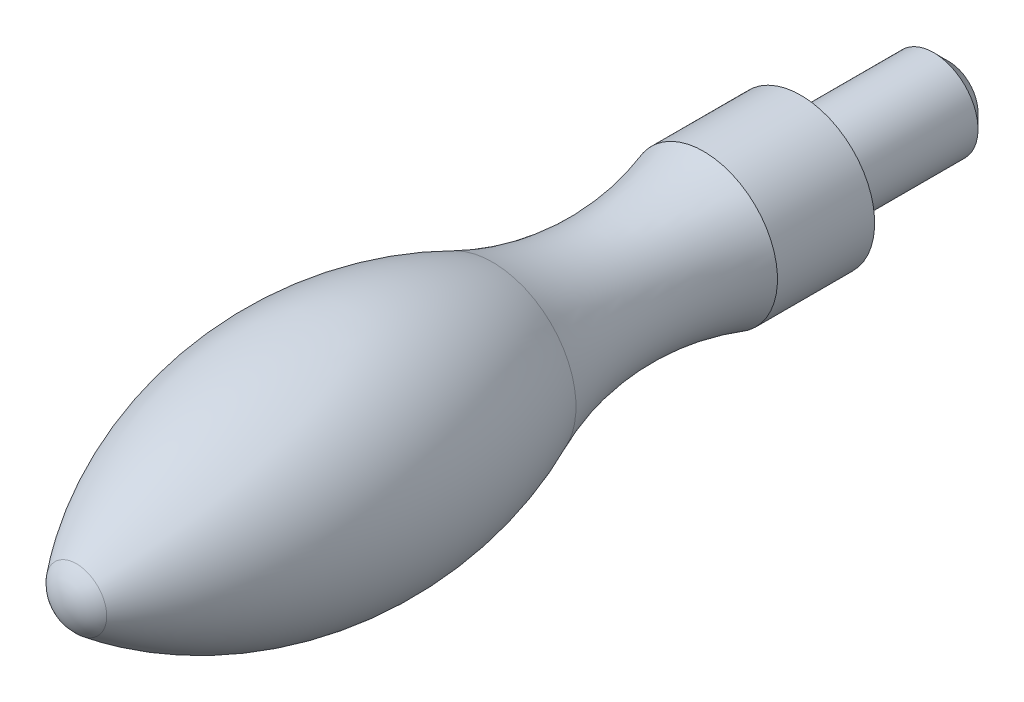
ISO-10303-21;
HEADER;
FILE_DESCRIPTION(('STEP AP214'),'2;1');
FILE_NAME('part.step','',(''),(''),'','','');
FILE_SCHEMA(('AUTOMOTIVE_DESIGN { 1 0 10303 214 1 1 1 1 }'));
ENDSEC;
DATA;
#1=APPLICATION_CONTEXT('core data for automotive mechanical design processes');
#2=APPLICATION_PROTOCOL_DEFINITION('international standard','automotive_design',2000,#1);
#3=PRODUCT_CONTEXT('',#1,'mechanical');
#4=PRODUCT('Part','Part','',(#3));
#5=PRODUCT_RELATED_PRODUCT_CATEGORY('part','',(#4));
#6=PRODUCT_DEFINITION_FORMATION('','',#4);
#7=PRODUCT_DEFINITION_CONTEXT('part definition',#1,'design');
#8=PRODUCT_DEFINITION('design','',#6,#7);
#9=PRODUCT_DEFINITION_SHAPE('','',#8);
#10=(LENGTH_UNIT() NAMED_UNIT(*) SI_UNIT(.MILLI.,.METRE.));
#11=(NAMED_UNIT(*) PLANE_ANGLE_UNIT() SI_UNIT($,.RADIAN.));
#12=(NAMED_UNIT(*) SI_UNIT($,.STERADIAN.) SOLID_ANGLE_UNIT());
#13=UNCERTAINTY_MEASURE_WITH_UNIT(LENGTH_MEASURE(1.E-05),#10,'distance_accuracy_value','');
#14=(GEOMETRIC_REPRESENTATION_CONTEXT(3) GLOBAL_UNCERTAINTY_ASSIGNED_CONTEXT((#13)) GLOBAL_UNIT_ASSIGNED_CONTEXT((#10,
#11,#12)) REPRESENTATION_CONTEXT('',''));
#15=CARTESIAN_POINT('',(0.,0.,0.));
#16=DIRECTION('',(0.,0.,1.));
#17=DIRECTION('',(1.,0.,0.));
#18=AXIS2_PLACEMENT_3D('',#15,#16,#17);
#19=CARTESIAN_POINT('',(0.,0.,94.5));
#20=DIRECTION('',(-1.,0.,0.));
#21=DIRECTION('',(0.,0.,1.));
#22=AXIS2_PLACEMENT_3D('',#19,#20,#21);
#23=SPHERICAL_SURFACE('',#22,5.5);
#24=CARTESIAN_POINT('',(0.,0.,94.5));
#25=DIRECTION('',(0.,0.,-1.));
#26=DIRECTION('',(-1.,0.,0.));
#27=AXIS2_PLACEMENT_3D('',#24,#25,#26);
#28=SPHERICAL_SURFACE('',#27,5.5);
#29=CARTESIAN_POINT('',(0.,0.,98.1578901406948));
#30=DIRECTION('',(0.,0.,-1.));
#31=DIRECTION('',(-1.,0.,0.));
#32=AXIS2_PLACEMENT_3D('',#29,#30,#31);
#33=CIRCLE('',#32,4.10729104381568);
#34=CARTESIAN_POINT('',(-4.10729104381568,0.,98.1578901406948));
#35=VERTEX_POINT('',#34);
#36=EDGE_CURVE('E23',#35,#35,#33,.T.);
#37=ORIENTED_EDGE('',*,*,#36,.F.);
#38=EDGE_LOOP('',(#37));
#39=FACE_BOUND('',#38,.T.);
#40=ADVANCED_FACE('F12',(#39),#28,.T.);
#41=CARTESIAN_POINT('',(0.,0.,64.));
#42=DIRECTION('',(0.,0.,-1.));
#43=DIRECTION('',(-1.,0.,0.));
#44=AXIS2_PLACEMENT_3D('',#41,#42,#43);
#45=DEGENERATE_TOROIDAL_SURFACE('',#44,39.,55.,.F.);
#46=CARTESIAN_POINT('',(0.,0.,41.7773793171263));
#47=DIRECTION('',(0.,0.,-1.));
#48=DIRECTION('',(-1.,0.,0.));
#49=AXIS2_PLACEMENT_3D('',#46,#47,#48);
#50=CIRCLE('',#49,11.310586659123);
#51=CARTESIAN_POINT('',(-11.310586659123,0.,41.7773793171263));
#52=VERTEX_POINT('',#51);
#53=EDGE_CURVE('E27',#52,#52,#50,.T.);
#54=ORIENTED_EDGE('',*,*,#53,.F.);
#55=EDGE_LOOP('',(#54));
#56=FACE_BOUND('',#55,.T.);
#57=ORIENTED_EDGE('',*,*,#36,.T.);
#58=EDGE_LOOP('',(#57));
#59=FACE_BOUND('',#58,.T.);
#60=ADVANCED_FACE('F61',(#56,#59),#45,.F.);
#61=CARTESIAN_POINT('',(0.,0.,25.74));
#62=DIRECTION('',(0.,0.,-1.));
#63=DIRECTION('',(-1.,0.,0.));
#64=AXIS2_PLACEMENT_3D('',#61,#62,#63);
#65=TOROIDAL_SURFACE('',#64,48.5,40.5);
#66=ORIENTED_EDGE('',*,*,#53,.T.);
#67=EDGE_LOOP('',(#66));
#68=FACE_BOUND('',#67,.T.);
#69=CARTESIAN_POINT('',(0.,0.,13.1701949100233));
#70=DIRECTION('',(0.,0.,-1.));
#71=DIRECTION('',(-1.,0.,0.));
#72=AXIS2_PLACEMENT_3D('',#69,#70,#71);
#73=CIRCLE('',#72,10.);
#74=CARTESIAN_POINT('',(-10.,0.,13.1701949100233));
#75=VERTEX_POINT('',#74);
#76=EDGE_CURVE('E32',#75,#75,#73,.T.);
#77=ORIENTED_EDGE('',*,*,#76,.F.);
#78=EDGE_LOOP('',(#77));
#79=FACE_BOUND('',#78,.T.);
#80=ADVANCED_FACE('F57',(#68,#79),#65,.F.);
#81=CARTESIAN_POINT('',(0.,0.,-25.));
#82=DIRECTION('',(0.,0.,-1.));
#83=DIRECTION('',(-1.,0.,0.));
#84=AXIS2_PLACEMENT_3D('',#81,#82,#83);
#85=CYLINDRICAL_SURFACE('',#84,10.);
#86=ORIENTED_EDGE('',*,*,#76,.T.);
#87=EDGE_LOOP('',(#86));
#88=FACE_BOUND('',#87,.T.);
#89=CARTESIAN_POINT('',(0.,0.,0.));
#90=DIRECTION('',(0.,0.,-1.));
#91=DIRECTION('',(-1.,0.,0.));
#92=AXIS2_PLACEMENT_3D('',#89,#90,#91);
#93=CIRCLE('',#92,10.);
#94=CARTESIAN_POINT('',(-10.,0.,0.));
#95=VERTEX_POINT('',#94);
#96=EDGE_CURVE('E35',#95,#95,#93,.T.);
#97=ORIENTED_EDGE('',*,*,#96,.F.);
#98=EDGE_LOOP('',(#97));
#99=FACE_BOUND('',#98,.T.);
#100=ADVANCED_FACE('F46',(#88,#99),#85,.T.);
#101=CARTESIAN_POINT('',(0.,6.,0.));
#102=DIRECTION('',(0.,0.,-1.));
#103=DIRECTION('',(-1.,0.,0.));
#104=AXIS2_PLACEMENT_3D('',#101,#102,#103);
#105=PLANE('',#104);
#106=ORIENTED_EDGE('',*,*,#96,.T.);
#107=EDGE_LOOP('',(#106));
#108=FACE_BOUND('',#107,.T.);
#109=CARTESIAN_POINT('',(0.,0.,0.));
#110=DIRECTION('',(0.,0.,-1.));
#111=DIRECTION('',(-1.,0.,0.));
#112=AXIS2_PLACEMENT_3D('',#109,#110,#111);
#113=CIRCLE('',#112,6.);
#114=CARTESIAN_POINT('',(-6.,0.,0.));
#115=VERTEX_POINT('',#114);
#116=EDGE_CURVE('E38',#115,#115,#113,.T.);
#117=ORIENTED_EDGE('',*,*,#116,.F.);
#118=EDGE_LOOP('',(#117));
#119=FACE_BOUND('',#118,.T.);
#120=ADVANCED_FACE('F44',(#108,#119),#105,.T.);
#121=CARTESIAN_POINT('',(0.,0.,-25.));
#122=DIRECTION('',(0.,0.,-1.));
#123=DIRECTION('',(-1.,0.,0.));
#124=AXIS2_PLACEMENT_3D('',#121,#122,#123);
#125=CYLINDRICAL_SURFACE('',#124,6.);
#126=CARTESIAN_POINT('',(0.,0.,-18.));
#127=DIRECTION('',(0.,0.,-1.));
#128=DIRECTION('',(-1.,0.,0.));
#129=AXIS2_PLACEMENT_3D('',#126,#127,#128);
#130=CIRCLE('',#129,6.);
#131=CARTESIAN_POINT('',(-6.,0.,-18.));
#132=VERTEX_POINT('',#131);
#133=EDGE_CURVE('E8',#132,#132,#130,.F.);
#134=ORIENTED_EDGE('',*,*,#133,.T.);
#135=EDGE_LOOP('',(#134));
#136=FACE_BOUND('',#135,.T.);
#137=ORIENTED_EDGE('',*,*,#116,.T.);
#138=EDGE_LOOP('',(#137));
#139=FACE_BOUND('',#138,.T.);
#140=ADVANCED_FACE('F42',(#136,#139),#125,.T.);
#141=CARTESIAN_POINT('',(0.,0.,-20.));
#142=DIRECTION('',(0.,0.,-1.));
#143=DIRECTION('',(-1.,0.,0.));
#144=AXIS2_PLACEMENT_3D('',#141,#142,#143);
#145=PLANE('',#144);
#146=CARTESIAN_POINT('',(0.,0.,-20.));
#147=DIRECTION('',(0.,0.,-1.));
#148=DIRECTION('',(-1.,0.,0.));
#149=AXIS2_PLACEMENT_3D('',#146,#147,#148);
#150=CIRCLE('',#149,4.);
#151=CARTESIAN_POINT('',(-4.,0.,-20.));
#152=VERTEX_POINT('',#151);
#153=EDGE_CURVE('E19',#152,#152,#150,.T.);
#154=ORIENTED_EDGE('',*,*,#153,.T.);
#155=EDGE_LOOP('',(#154));
#156=FACE_BOUND('',#155,.T.);
#157=ADVANCED_FACE('F55',(#156),#145,.T.);
#158=CARTESIAN_POINT('',(0.,0.,-20.));
#159=DIRECTION('',(0.,0.,1.));
#160=DIRECTION('',(1.,0.,0.));
#161=AXIS2_PLACEMENT_3D('',#158,#159,#160);
#162=CONICAL_SURFACE('',#161,4.,0.785398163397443);
#163=ORIENTED_EDGE('',*,*,#133,.F.);
#164=EDGE_LOOP('',(#163));
#165=FACE_BOUND('',#164,.T.);
#166=ORIENTED_EDGE('',*,*,#153,.F.);
#167=EDGE_LOOP('',(#166));
#168=FACE_BOUND('',#167,.T.);
#169=ADVANCED_FACE('F14',(#165,#168),#162,.T.);
#170=CLOSED_SHELL('',(#40,#60,#80,#100,#120,#140,#157,#169));
#171=MANIFOLD_SOLID_BREP('B1',#170);
#172=ADVANCED_BREP_SHAPE_REPRESENTATION('',(#18,#171),#14);
#173=SHAPE_DEFINITION_REPRESENTATION(#9,#172);
ENDSEC;
END-ISO-10303-21;
